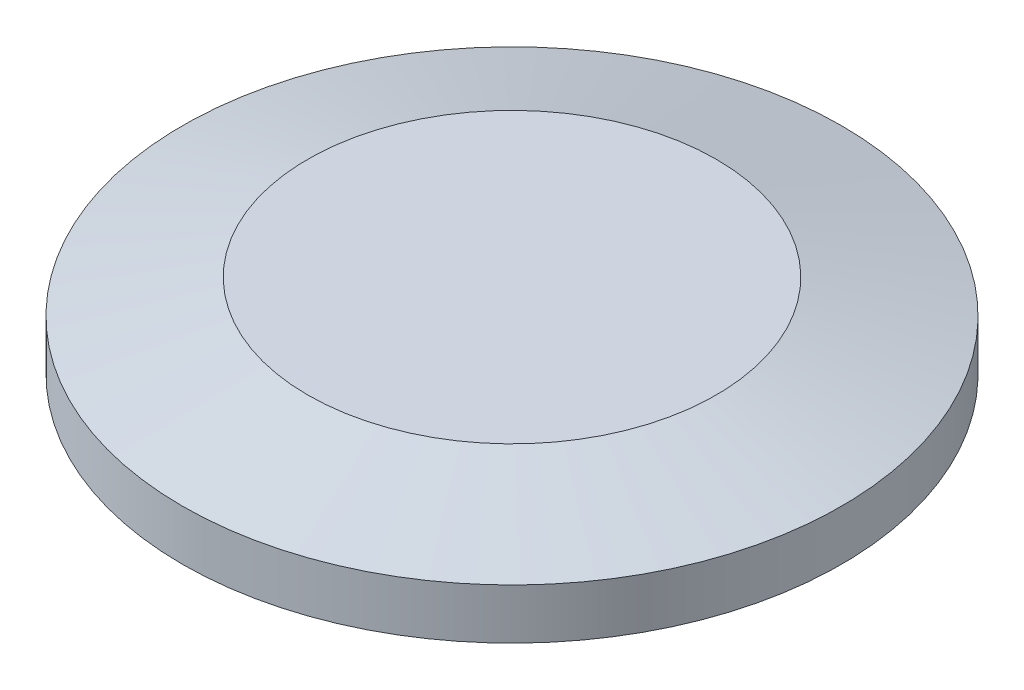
ISO-10303-21;
HEADER;
FILE_DESCRIPTION(('STEP AP214'),'2;1');
FILE_NAME('part.step','',(''),(''),'','','');
FILE_SCHEMA(('AUTOMOTIVE_DESIGN { 1 0 10303 214 1 1 1 1 }'));
ENDSEC;
DATA;
#1=APPLICATION_CONTEXT('core data for automotive mechanical design processes');
#2=APPLICATION_PROTOCOL_DEFINITION('international standard','automotive_design',2000,#1);
#3=PRODUCT_CONTEXT('',#1,'mechanical');
#4=PRODUCT('Part','Part','',(#3));
#5=PRODUCT_RELATED_PRODUCT_CATEGORY('part','',(#4));
#6=PRODUCT_DEFINITION_FORMATION('','',#4);
#7=PRODUCT_DEFINITION_CONTEXT('part definition',#1,'design');
#8=PRODUCT_DEFINITION('design','',#6,#7);
#9=PRODUCT_DEFINITION_SHAPE('','',#8);
#10=(LENGTH_UNIT() NAMED_UNIT(*) SI_UNIT(.MILLI.,.METRE.));
#11=(NAMED_UNIT(*) PLANE_ANGLE_UNIT() SI_UNIT($,.RADIAN.));
#12=(NAMED_UNIT(*) SI_UNIT($,.STERADIAN.) SOLID_ANGLE_UNIT());
#13=UNCERTAINTY_MEASURE_WITH_UNIT(LENGTH_MEASURE(1.E-05),#10,'distance_accuracy_value','');
#14=(GEOMETRIC_REPRESENTATION_CONTEXT(3) GLOBAL_UNCERTAINTY_ASSIGNED_CONTEXT((#13)) GLOBAL_UNIT_ASSIGNED_CONTEXT((#10,
#11,#12)) REPRESENTATION_CONTEXT('',''));
#15=CARTESIAN_POINT('',(0.,0.,0.));
#16=DIRECTION('',(0.,0.,1.));
#17=DIRECTION('',(1.,0.,0.));
#18=AXIS2_PLACEMENT_3D('',#15,#16,#17);
#19=CARTESIAN_POINT('',(0.,0.,0.));
#20=DIRECTION('',(0.,1.,0.));
#21=DIRECTION('',(0.,0.,1.));
#22=AXIS2_PLACEMENT_3D('',#19,#20,#21);
#23=PLANE('',#22);
#24=CARTESIAN_POINT('',(0.,0.,0.));
#25=DIRECTION('',(0.,-1.,0.));
#26=DIRECTION('',(0.,0.,-1.));
#27=AXIS2_PLACEMENT_3D('',#24,#25,#26);
#28=CIRCLE('',#27,13.208);
#29=CARTESIAN_POINT('',(2.22405252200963E-13,0.,-13.2079999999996));
#30=VERTEX_POINT('',#29);
#31=EDGE_CURVE('E49',#30,#30,#28,.T.);
#32=ORIENTED_EDGE('',*,*,#31,.F.);
#33=EDGE_LOOP('',(#32));
#34=FACE_BOUND('',#33,.T.);
#35=CARTESIAN_POINT('',(0.,0.,0.));
#36=DIRECTION('',(0.,1.,0.));
#37=DIRECTION('',(0.,0.,1.));
#38=AXIS2_PLACEMENT_3D('',#35,#36,#37);
#39=CIRCLE('',#38,19.939);
#40=CARTESIAN_POINT('',(0.,0.,19.939));
#41=VERTEX_POINT('',#40);
#42=EDGE_CURVE('E10',#41,#41,#39,.T.);
#43=ORIENTED_EDGE('',*,*,#42,.F.);
#44=EDGE_LOOP('',(#43));
#45=FACE_BOUND('',#44,.T.);
#46=ADVANCED_FACE('F32',(#34,#45),#23,.F.);
#47=CARTESIAN_POINT('',(0.,0.,0.));
#48=DIRECTION('',(0.,1.,0.));
#49=DIRECTION('',(0.,0.,1.));
#50=AXIS2_PLACEMENT_3D('',#47,#48,#49);
#51=CYLINDRICAL_SURFACE('',#50,19.939);
#52=CARTESIAN_POINT('',(0.,3.04800000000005,-1.11022302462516E-13));
#53=DIRECTION('',(0.,1.,0.));
#54=DIRECTION('',(0.,0.,1.));
#55=AXIS2_PLACEMENT_3D('',#52,#53,#54);
#56=CIRCLE('',#55,19.939);
#57=CARTESIAN_POINT('',(0.,3.04800000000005,19.9389999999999));
#58=VERTEX_POINT('',#57);
#59=EDGE_CURVE('E38',#58,#58,#56,.T.);
#60=ORIENTED_EDGE('',*,*,#59,.F.);
#61=EDGE_LOOP('',(#60));
#62=FACE_BOUND('',#61,.T.);
#63=ORIENTED_EDGE('',*,*,#42,.T.);
#64=EDGE_LOOP('',(#63));
#65=FACE_BOUND('',#64,.T.);
#66=ADVANCED_FACE('F79',(#62,#65),#51,.T.);
#67=CARTESIAN_POINT('',(0.,3.04800000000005,-1.11022302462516E-13));
#68=DIRECTION('',(0.,-1.,0.));
#69=DIRECTION('',(0.,0.,-1.));
#70=AXIS2_PLACEMENT_3D('',#67,#68,#69);
#71=CONICAL_SURFACE('',#70,19.939,1.30899693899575);
#72=CARTESIAN_POINT('',(3.33066907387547E-13,5.07999999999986,-1.11022302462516E-13));
#73=DIRECTION('',(0.,1.,0.));
#74=DIRECTION('',(0.,0.,1.));
#75=AXIS2_PLACEMENT_3D('',#72,#73,#74);
#76=CIRCLE('',#75,12.3554727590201);
#77=CARTESIAN_POINT('',(3.32723974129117E-13,5.07999999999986,12.3554727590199));
#78=VERTEX_POINT('',#77);
#79=EDGE_CURVE('E42',#78,#78,#76,.T.);
#80=ORIENTED_EDGE('',*,*,#79,.F.);
#81=EDGE_LOOP('',(#80));
#82=FACE_BOUND('',#81,.T.);
#83=ORIENTED_EDGE('',*,*,#59,.T.);
#84=EDGE_LOOP('',(#83));
#85=FACE_BOUND('',#84,.T.);
#86=ADVANCED_FACE('F84',(#82,#85),#71,.T.);
#87=CARTESIAN_POINT('',(0.,5.07999999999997,-12.3554727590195));
#88=DIRECTION('',(0.,-1.,0.));
#89=DIRECTION('',(0.,0.,-1.));
#90=AXIS2_PLACEMENT_3D('',#87,#88,#89);
#91=PLANE('',#90);
#92=ORIENTED_EDGE('',*,*,#79,.T.);
#93=EDGE_LOOP('',(#92));
#94=FACE_BOUND('',#93,.T.);
#95=ADVANCED_FACE('F73',(#94),#91,.F.);
#96=CARTESIAN_POINT('',(2.22044604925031E-13,1.5240000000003,4.44089209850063E-13));
#97=DIRECTION('',(0.,-1.,0.));
#98=DIRECTION('',(0.,0.,-1.));
#99=AXIS2_PLACEMENT_3D('',#96,#97,#98);
#100=CYLINDRICAL_SURFACE('',#99,13.208);
#101=CARTESIAN_POINT('',(2.22044604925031E-13,1.5240000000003,4.44089209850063E-13));
#102=DIRECTION('',(0.,-1.,0.));
#103=DIRECTION('',(0.,0.,-1.));
#104=AXIS2_PLACEMENT_3D('',#101,#102,#103);
#105=CIRCLE('',#104,13.208);
#106=CARTESIAN_POINT('',(2.22411200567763E-13,1.5240000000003,-13.2079999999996));
#107=VERTEX_POINT('',#106);
#108=EDGE_CURVE('E46',#107,#107,#105,.T.);
#109=CARTESIAN_POINT('',(2.22411200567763E-13,1.5240000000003,-13.2079999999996));
#110=CARTESIAN_POINT('',(2.22411138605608E-13,1.5081250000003,-13.2079999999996));
#111=CARTESIAN_POINT('',(2.22411076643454E-13,1.4922500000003,-13.2079999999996));
#112=CARTESIAN_POINT('',(2.22410952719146E-13,1.46050000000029,-13.2079999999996));
#113=CARTESIAN_POINT('',(2.22410890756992E-13,1.44462500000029,-13.2079999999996));
#114=CARTESIAN_POINT('',(2.22410766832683E-13,1.41287500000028,-13.2079999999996));
#115=CARTESIAN_POINT('',(2.22410704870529E-13,1.39700000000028,-13.2079999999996));
#116=CARTESIAN_POINT('',(2.22410580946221E-13,1.36525000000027,-13.2079999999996));
#117=CARTESIAN_POINT('',(2.22410518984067E-13,1.34937500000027,-13.2079999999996));
#118=CARTESIAN_POINT('',(2.22410395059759E-13,1.31762500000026,-13.2079999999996));
#119=CARTESIAN_POINT('',(2.22410333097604E-13,1.30175000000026,-13.2079999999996));
#120=CARTESIAN_POINT('',(2.22410209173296E-13,1.27000000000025,-13.2079999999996));
#121=CARTESIAN_POINT('',(2.22410147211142E-13,1.25412500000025,-13.2079999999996));
#122=CARTESIAN_POINT('',(2.22410023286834E-13,1.22237500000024,-13.2079999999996));
#123=CARTESIAN_POINT('',(2.22409961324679E-13,1.20650000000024,-13.2079999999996));
#124=CARTESIAN_POINT('',(2.22409837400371E-13,1.17475000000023,-13.2079999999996));
#125=CARTESIAN_POINT('',(2.22409775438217E-13,1.15887500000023,-13.2079999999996));
#126=CARTESIAN_POINT('',(2.22409651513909E-13,1.12712500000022,-13.2079999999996));
#127=CARTESIAN_POINT('',(2.22409589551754E-13,1.11125000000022,-13.2079999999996));
#128=CARTESIAN_POINT('',(2.22409465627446E-13,1.07950000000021,-13.2079999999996));
#129=CARTESIAN_POINT('',(2.22409403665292E-13,1.06362500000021,-13.2079999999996));
#130=CARTESIAN_POINT('',(2.22409279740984E-13,1.0318750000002,-13.2079999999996));
#131=CARTESIAN_POINT('',(2.2240921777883E-13,1.0160000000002,-13.2079999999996));
#132=CARTESIAN_POINT('',(2.22409093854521E-13,0.984250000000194,-13.2079999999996));
#133=CARTESIAN_POINT('',(2.22409031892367E-13,0.968375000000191,-13.2079999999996));
#134=CARTESIAN_POINT('',(2.22408907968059E-13,0.936625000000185,-13.2079999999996));
#135=CARTESIAN_POINT('',(2.22408846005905E-13,0.920750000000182,-13.2079999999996));
#136=CARTESIAN_POINT('',(2.22408722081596E-13,0.889000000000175,-13.2079999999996));
#137=CARTESIAN_POINT('',(2.22408660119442E-13,0.873125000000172,-13.2079999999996));
#138=CARTESIAN_POINT('',(2.22408536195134E-13,0.841375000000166,-13.2079999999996));
#139=CARTESIAN_POINT('',(2.2240847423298E-13,0.825500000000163,-13.2079999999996));
#140=CARTESIAN_POINT('',(2.22408350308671E-13,0.793750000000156,-13.2079999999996));
#141=CARTESIAN_POINT('',(2.22408288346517E-13,0.777875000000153,-13.2079999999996));
#142=CARTESIAN_POINT('',(2.22408164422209E-13,0.746125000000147,-13.2079999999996));
#143=CARTESIAN_POINT('',(2.22408102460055E-13,0.730250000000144,-13.2079999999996));
#144=CARTESIAN_POINT('',(2.22407978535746E-13,0.698500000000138,-13.2079999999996));
#145=CARTESIAN_POINT('',(2.22407916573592E-13,0.682625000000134,-13.2079999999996));
#146=CARTESIAN_POINT('',(2.22407792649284E-13,0.650875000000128,-13.2079999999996));
#147=CARTESIAN_POINT('',(2.2240773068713E-13,0.635000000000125,-13.2079999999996));
#148=CARTESIAN_POINT('',(2.22407606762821E-13,0.603250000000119,-13.2079999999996));
#149=CARTESIAN_POINT('',(2.22407544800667E-13,0.587375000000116,-13.2079999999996));
#150=CARTESIAN_POINT('',(2.22407420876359E-13,0.555625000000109,-13.2079999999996));
#151=CARTESIAN_POINT('',(2.22407358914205E-13,0.539750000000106,-13.2079999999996));
#152=CARTESIAN_POINT('',(2.22407234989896E-13,0.5080000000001,-13.2079999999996));
#153=CARTESIAN_POINT('',(2.22407173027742E-13,0.492125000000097,-13.2079999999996));
#154=CARTESIAN_POINT('',(2.22407049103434E-13,0.46037500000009,-13.2079999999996));
#155=CARTESIAN_POINT('',(2.2240698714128E-13,0.444500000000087,-13.2079999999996));
#156=CARTESIAN_POINT('',(2.22406863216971E-13,0.412750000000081,-13.2079999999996));
#157=CARTESIAN_POINT('',(2.22406801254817E-13,0.396875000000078,-13.2079999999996));
#158=CARTESIAN_POINT('',(2.22406677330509E-13,0.365125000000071,-13.2079999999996));
#159=CARTESIAN_POINT('',(2.22406615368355E-13,0.349250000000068,-13.2079999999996));
#160=CARTESIAN_POINT('',(2.22406491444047E-13,0.317500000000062,-13.2079999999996));
#161=CARTESIAN_POINT('',(2.22406429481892E-13,0.301625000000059,-13.2079999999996));
#162=CARTESIAN_POINT('',(2.22406305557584E-13,0.269875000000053,-13.2079999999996));
#163=CARTESIAN_POINT('',(2.2240624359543E-13,0.254000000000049,-13.2079999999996));
#164=CARTESIAN_POINT('',(2.22406119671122E-13,0.222250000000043,-13.2079999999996));
#165=CARTESIAN_POINT('',(2.22406057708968E-13,0.20637500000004,-13.2079999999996));
#166=CARTESIAN_POINT('',(2.22405933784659E-13,0.174625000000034,-13.2079999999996));
#167=CARTESIAN_POINT('',(2.22405871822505E-13,0.15875000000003,-13.2079999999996));
#168=CARTESIAN_POINT('',(2.22405747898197E-13,0.127000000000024,-13.2079999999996));
#169=CARTESIAN_POINT('',(2.22405685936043E-13,0.111125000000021,-13.2079999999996));
#170=CARTESIAN_POINT('',(2.22405562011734E-13,0.0793750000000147,-13.2079999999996));
#171=CARTESIAN_POINT('',(2.2240550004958E-13,0.0635000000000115,-13.2079999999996));
#172=CARTESIAN_POINT('',(2.22405376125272E-13,0.0317500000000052,-13.2079999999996));
#173=CARTESIAN_POINT('',(2.22405314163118E-13,0.0158750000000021,-13.2079999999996));
#174=CARTESIAN_POINT('',(2.22405252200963E-13,0.,-13.2079999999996));
#175=B_SPLINE_CURVE_WITH_KNOTS('',3,(#109,#110,#111,#112,#113,#114,#115,#116,#117,#118,#119,
#120,#121,#122,#123,#124,#125,#126,#127,#128,#129,#130,#131,#132,#133,#134,#135,#136,#137,#138,
#139,#140,#141,#142,#143,#144,#145,#146,#147,#148,#149,#150,#151,#152,#153,#154,#155,#156,#157,
#158,#159,#160,#161,#162,#163,#164,#165,#166,#167,#168,#169,#170,#171,#172,#173,#174),
.UNSPECIFIED.,.F.,.F.,(4,2,2,2,2,2,2,2,2,2,2,2,2,2,2,2,2,2,2,2,2,2,2,2,2,2,2,2,2,2,2,2,4),(0.,
0.0476250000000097,0.0952500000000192,0.142875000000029,0.190500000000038,0.238125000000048,
0.285750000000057,0.333375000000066,0.381000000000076,0.428625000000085,0.476250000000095,
0.523875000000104,0.571500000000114,0.619125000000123,0.666750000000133,0.714375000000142,
0.762000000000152,0.809625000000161,0.85725000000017,0.90487500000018,0.952500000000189,
1.0001250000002,1.04775000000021,1.09537500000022,1.14300000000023,1.19062500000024,
1.23825000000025,1.28587500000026,1.33350000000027,1.38112500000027,1.42875000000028,
1.47637500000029,1.5240000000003),.UNSPECIFIED.);
#176=EDGE_CURVE('BSEAM67',#107,#30,#175,.T.);
#177=ORIENTED_EDGE('',*,*,#108,.F.);
#178=ORIENTED_EDGE('',*,*,#31,.T.);
#179=ORIENTED_EDGE('',*,*,#176,.T.);
#180=ORIENTED_EDGE('',*,*,#176,.F.);
#181=EDGE_LOOP('',(#177,#179,#178,#180));
#182=FACE_BOUND('',#181,.T.);
#183=ADVANCED_FACE('F67',(#182),#100,.F.);
#184=CARTESIAN_POINT('',(2.22044604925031E-13,1.5240000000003,4.44089209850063E-13));
#185=DIRECTION('',(0.,-1.,0.));
#186=DIRECTION('',(0.,0.,-1.));
#187=AXIS2_PLACEMENT_3D('',#184,#185,#186);
#188=PLANE('',#187);
#189=CARTESIAN_POINT('',(2.22044604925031E-13,1.5240000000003,4.44089209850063E-13));
#190=DIRECTION('',(0.,-1.,0.));
#191=DIRECTION('',(0.,0.,-1.));
#192=AXIS2_PLACEMENT_3D('',#189,#190,#191);
#193=CIRCLE('',#192,10.033);
#194=CARTESIAN_POINT('',(2.22323076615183E-13,1.5240000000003,-10.0329999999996));
#195=VERTEX_POINT('',#194);
#196=EDGE_CURVE('E52',#195,#195,#193,.T.);
#197=ORIENTED_EDGE('',*,*,#196,.F.);
#198=EDGE_LOOP('',(#197));
#199=FACE_BOUND('',#198,.T.);
#200=ORIENTED_EDGE('',*,*,#108,.T.);
#201=EDGE_LOOP('',(#200));
#202=FACE_BOUND('',#201,.T.);
#203=ADVANCED_FACE('F64',(#199,#202),#188,.T.);
#204=CARTESIAN_POINT('',(2.22044604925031E-13,1.5240000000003,4.44089209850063E-13));
#205=DIRECTION('',(0.,-1.,0.));
#206=DIRECTION('',(0.,0.,-1.));
#207=AXIS2_PLACEMENT_3D('',#204,#205,#206);
#208=CYLINDRICAL_SURFACE('',#207,10.033);
#209=CARTESIAN_POINT('',(0.,0.,0.));
#210=DIRECTION('',(0.,-1.,0.));
#211=DIRECTION('',(0.,0.,-1.));
#212=AXIS2_PLACEMENT_3D('',#209,#210,#211);
#213=CIRCLE('',#212,10.033);
#214=CARTESIAN_POINT('',(2.22317128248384E-13,0.,-10.0329999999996));
#215=VERTEX_POINT('',#214);
#216=EDGE_CURVE('E55',#215,#215,#213,.T.);
#217=CARTESIAN_POINT('',(2.22323076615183E-13,1.5240000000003,-10.0329999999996));
#218=CARTESIAN_POINT('',(2.22323014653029E-13,1.5081250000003,-10.0329999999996));
#219=CARTESIAN_POINT('',(2.22322952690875E-13,1.4922500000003,-10.0329999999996));
#220=CARTESIAN_POINT('',(2.22322828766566E-13,1.46050000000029,-10.0329999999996));
#221=CARTESIAN_POINT('',(2.22322766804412E-13,1.44462500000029,-10.0329999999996));
#222=CARTESIAN_POINT('',(2.22322642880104E-13,1.41287500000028,-10.0329999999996));
#223=CARTESIAN_POINT('',(2.2232258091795E-13,1.39700000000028,-10.0329999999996));
#224=CARTESIAN_POINT('',(2.22322456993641E-13,1.36525000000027,-10.0329999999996));
#225=CARTESIAN_POINT('',(2.22322395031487E-13,1.34937500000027,-10.0329999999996));
#226=CARTESIAN_POINT('',(2.22322271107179E-13,1.31762500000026,-10.0329999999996));
#227=CARTESIAN_POINT('',(2.22322209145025E-13,1.30175000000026,-10.0329999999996));
#228=CARTESIAN_POINT('',(2.22322085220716E-13,1.27000000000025,-10.0329999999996));
#229=CARTESIAN_POINT('',(2.22322023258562E-13,1.25412500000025,-10.0329999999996));
#230=CARTESIAN_POINT('',(2.22321899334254E-13,1.22237500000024,-10.0329999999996));
#231=CARTESIAN_POINT('',(2.223218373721E-13,1.20650000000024,-10.0329999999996));
#232=CARTESIAN_POINT('',(2.22321713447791E-13,1.17475000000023,-10.0329999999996));
#233=CARTESIAN_POINT('',(2.22321651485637E-13,1.15887500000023,-10.0329999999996));
#234=CARTESIAN_POINT('',(2.22321527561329E-13,1.12712500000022,-10.0329999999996));
#235=CARTESIAN_POINT('',(2.22321465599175E-13,1.11125000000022,-10.0329999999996));
#236=CARTESIAN_POINT('',(2.22321341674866E-13,1.07950000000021,-10.0329999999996));
#237=CARTESIAN_POINT('',(2.22321279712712E-13,1.06362500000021,-10.0329999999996));
#238=CARTESIAN_POINT('',(2.22321155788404E-13,1.0318750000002,-10.0329999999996));
#239=CARTESIAN_POINT('',(2.2232109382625E-13,1.0160000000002,-10.0329999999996));
#240=CARTESIAN_POINT('',(2.22320969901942E-13,0.984250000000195,-10.0329999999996));
#241=CARTESIAN_POINT('',(2.22320907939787E-13,0.968375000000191,-10.0329999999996));
#242=CARTESIAN_POINT('',(2.22320784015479E-13,0.936625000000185,-10.0329999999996));
#243=CARTESIAN_POINT('',(2.22320722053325E-13,0.920750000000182,-10.0329999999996));
#244=CARTESIAN_POINT('',(2.22320598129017E-13,0.889000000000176,-10.0329999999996));
#245=CARTESIAN_POINT('',(2.22320536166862E-13,0.873125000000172,-10.0329999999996));
#246=CARTESIAN_POINT('',(2.22320412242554E-13,0.841375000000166,-10.0329999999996));
#247=CARTESIAN_POINT('',(2.223203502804E-13,0.825500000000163,-10.0329999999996));
#248=CARTESIAN_POINT('',(2.22320226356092E-13,0.793750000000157,-10.0329999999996));
#249=CARTESIAN_POINT('',(2.22320164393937E-13,0.777875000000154,-10.0329999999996));
#250=CARTESIAN_POINT('',(2.22320040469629E-13,0.746125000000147,-10.0329999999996));
#251=CARTESIAN_POINT('',(2.22319978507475E-13,0.730250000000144,-10.0329999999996));
#252=CARTESIAN_POINT('',(2.22319854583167E-13,0.698500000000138,-10.0329999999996));
#253=CARTESIAN_POINT('',(2.22319792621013E-13,0.682625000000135,-10.0329999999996));
#254=CARTESIAN_POINT('',(2.22319668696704E-13,0.650875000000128,-10.0329999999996));
#255=CARTESIAN_POINT('',(2.2231960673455E-13,0.635000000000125,-10.0329999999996));
#256=CARTESIAN_POINT('',(2.22319482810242E-13,0.603250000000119,-10.0329999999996));
#257=CARTESIAN_POINT('',(2.22319420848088E-13,0.587375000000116,-10.0329999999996));
#258=CARTESIAN_POINT('',(2.22319296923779E-13,0.555625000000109,-10.0329999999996));
#259=CARTESIAN_POINT('',(2.22319234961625E-13,0.539750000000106,-10.0329999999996));
#260=CARTESIAN_POINT('',(2.22319111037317E-13,0.5080000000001,-10.0329999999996));
#261=CARTESIAN_POINT('',(2.22319049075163E-13,0.492125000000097,-10.0329999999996));
#262=CARTESIAN_POINT('',(2.22318925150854E-13,0.460375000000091,-10.0329999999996));
#263=CARTESIAN_POINT('',(2.223188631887E-13,0.444500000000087,-10.0329999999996));
#264=CARTESIAN_POINT('',(2.22318739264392E-13,0.412750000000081,-10.0329999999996));
#265=CARTESIAN_POINT('',(2.22318677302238E-13,0.396875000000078,-10.0329999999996));
#266=CARTESIAN_POINT('',(2.22318553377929E-13,0.365125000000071,-10.0329999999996));
#267=CARTESIAN_POINT('',(2.22318491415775E-13,0.349250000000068,-10.0329999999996));
#268=CARTESIAN_POINT('',(2.22318367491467E-13,0.317500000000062,-10.0329999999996));
#269=CARTESIAN_POINT('',(2.22318305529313E-13,0.301625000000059,-10.0329999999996));
#270=CARTESIAN_POINT('',(2.22318181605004E-13,0.269875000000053,-10.0329999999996));
#271=CARTESIAN_POINT('',(2.2231811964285E-13,0.254000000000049,-10.0329999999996));
#272=CARTESIAN_POINT('',(2.22317995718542E-13,0.222250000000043,-10.0329999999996));
#273=CARTESIAN_POINT('',(2.22317933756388E-13,0.20637500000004,-10.0329999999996));
#274=CARTESIAN_POINT('',(2.22317809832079E-13,0.174625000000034,-10.0329999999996));
#275=CARTESIAN_POINT('',(2.22317747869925E-13,0.15875000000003,-10.0329999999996));
#276=CARTESIAN_POINT('',(2.22317623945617E-13,0.127000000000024,-10.0329999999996));
#277=CARTESIAN_POINT('',(2.22317561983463E-13,0.111125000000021,-10.0329999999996));
#278=CARTESIAN_POINT('',(2.22317438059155E-13,0.0793750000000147,-10.0329999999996));
#279=CARTESIAN_POINT('',(2.22317376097E-13,0.0635000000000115,-10.0329999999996));
#280=CARTESIAN_POINT('',(2.22317252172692E-13,0.0317500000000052,-10.0329999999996));
#281=CARTESIAN_POINT('',(2.22317190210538E-13,0.0158750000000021,-10.0329999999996));
#282=CARTESIAN_POINT('',(2.22317128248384E-13,0.,-10.0329999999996));
#283=B_SPLINE_CURVE_WITH_KNOTS('',3,(#217,#218,#219,#220,#221,#222,#223,#224,#225,#226,#227,
#228,#229,#230,#231,#232,#233,#234,#235,#236,#237,#238,#239,#240,#241,#242,#243,#244,#245,#246,
#247,#248,#249,#250,#251,#252,#253,#254,#255,#256,#257,#258,#259,#260,#261,#262,#263,#264,#265,
#266,#267,#268,#269,#270,#271,#272,#273,#274,#275,#276,#277,#278,#279,#280,#281,#282),
.UNSPECIFIED.,.F.,.F.,(4,2,2,2,2,2,2,2,2,2,2,2,2,2,2,2,2,2,2,2,2,2,2,2,2,2,2,2,2,2,2,2,4),(0.,
0.0476250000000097,0.0952500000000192,0.142875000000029,0.190500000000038,0.238125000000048,
0.285750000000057,0.333375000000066,0.381000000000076,0.428625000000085,0.476250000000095,
0.523875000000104,0.571500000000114,0.619125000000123,0.666750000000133,0.714375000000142,
0.762000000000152,0.809625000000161,0.857250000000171,0.90487500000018,0.95250000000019,
1.0001250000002,1.04775000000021,1.09537500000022,1.14300000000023,1.19062500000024,
1.23825000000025,1.28587500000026,1.33350000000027,1.38112500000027,1.42875000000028,
1.47637500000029,1.5240000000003),.UNSPECIFIED.);
#284=EDGE_CURVE('BSEAM61',#195,#215,#283,.T.);
#285=ORIENTED_EDGE('',*,*,#196,.T.);
#286=ORIENTED_EDGE('',*,*,#216,.F.);
#287=ORIENTED_EDGE('',*,*,#284,.T.);
#288=ORIENTED_EDGE('',*,*,#284,.F.);
#289=EDGE_LOOP('',(#285,#287,#286,#288));
#290=FACE_BOUND('',#289,.T.);
#291=ADVANCED_FACE('F61',(#290),#208,.T.);
#292=ORIENTED_EDGE('',*,*,#216,.T.);
#293=EDGE_LOOP('',(#292));
#294=FACE_BOUND('',#293,.T.);
#295=ADVANCED_FACE('F80',(#294),#23,.F.);
#296=CLOSED_SHELL('',(#46,#66,#86,#95,#183,#203,#291,#295));
#297=MANIFOLD_SOLID_BREP('B2',#296);
#298=ADVANCED_BREP_SHAPE_REPRESENTATION('',(#18,#297),#14);
#299=SHAPE_DEFINITION_REPRESENTATION(#9,#298);
ENDSEC;
END-ISO-10303-21;
